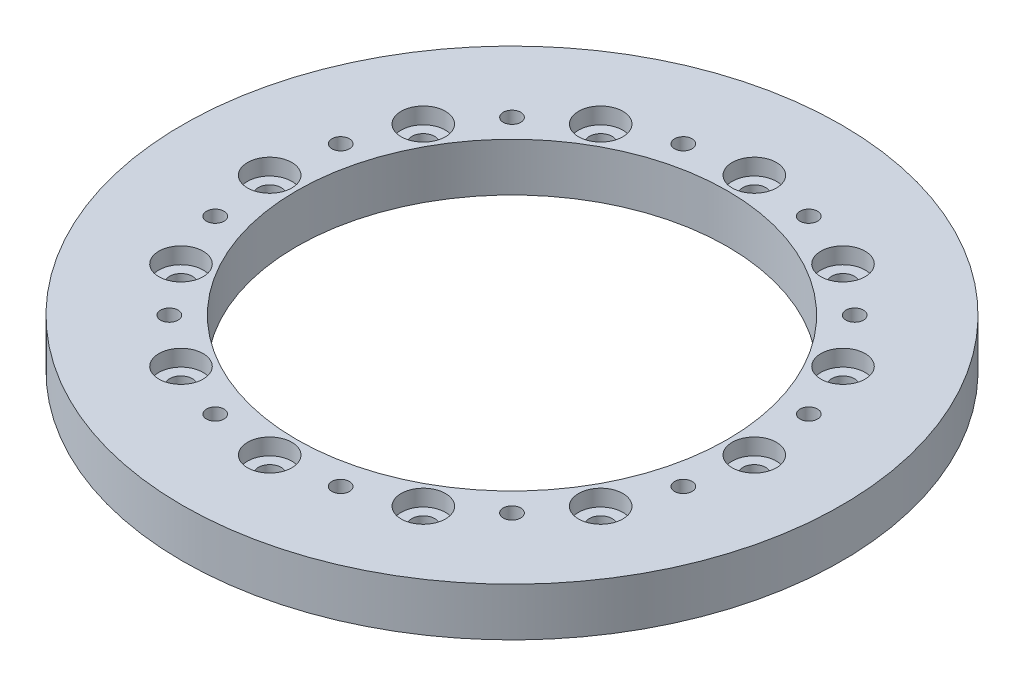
from build123d import *

# Parameters (mm, degrees)
SKETCH1_R                                      = 65.015198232
SKETCH1_R_2                                    = 42.5
BOSS_EXTRUDE1_DEPTH                            = 9.525
CBORE_FOR_8_BUTTON_HEAD_CAP_SCREW1_D           = 4.4958
CBORE_FOR_8_BUTTON_HEAD_CAP_SCREW1_CBORE_D     = 8.73252
CBORE_FOR_8_BUTTON_HEAD_CAP_SCREW1_CBORE_DEPTH = 3.2258
CIRPATTERN1_COUNT                              = 12
F_8_32_TAPPED_HOLE1_D                          = 3.4544
CIRPATTERN2_COUNT                              = 12


with BuildPart() as part:
    # Sketch1 → Boss-Extrude1 (new body)
    with BuildSketch(Plane(origin=(0, 0, 0), x_dir=(1, 0, 0), z_dir=(0, 1, 0))):
        with Locations(Location((0, 0, 0), (0, 0, 90))):
            Circle(SKETCH1_R)
        with Locations(Location((0, 0, 0), (0, 0, 90))):
            Circle(SKETCH1_R_2, mode=Mode.SUBTRACT)
    extrude(amount=BOSS_EXTRUDE1_DEPTH)

    # CBORE for _8 Button Head Cap Screw1 (through all)
    with Locations(Plane(origin=(0, 9.525, 0), x_dir=(1, 0, 0), z_dir=(0, 1, 0))):
        with Locations((47.8028, 0)):
            cbore_for_8_button_head_cap_screw1 = CounterBoreHole(CBORE_FOR_8_BUTTON_HEAD_CAP_SCREW1_D / 2, CBORE_FOR_8_BUTTON_HEAD_CAP_SCREW1_CBORE_D / 2, CBORE_FOR_8_BUTTON_HEAD_CAP_SCREW1_CBORE_DEPTH)

    # CirPattern1: CBORE for _8 Button Head Cap Screw1 ×12 about axis
    cirpattern1_axis = Axis((0, 0, 0), (0, 1, 0))
    for i in range(1, CIRPATTERN1_COUNT):
        add(cbore_for_8_button_head_cap_screw1.rotate(cirpattern1_axis, i * 360 / CIRPATTERN1_COUNT), mode=Mode.SUBTRACT)

    # 8-32 Tapped Hole1 (through all)
    with Locations(Plane(origin=(0, 9.525, 0), x_dir=(1, 0, 0), z_dir=(0, 1, 0))):
        with Locations((12.372275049, 46.173959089)):
            f_8_32_tapped_hole1 = Hole(F_8_32_TAPPED_HOLE1_D / 2)

    # CirPattern2: 8-32 Tapped Hole1 ×12 about axis
    cirpattern2_axis = Axis((0, 0, 0), (0, 1, 0))
    for i in range(1, CIRPATTERN2_COUNT):
        add(f_8_32_tapped_hole1.rotate(cirpattern2_axis, i * 360 / CIRPATTERN2_COUNT), mode=Mode.SUBTRACT)


solid = part.part
